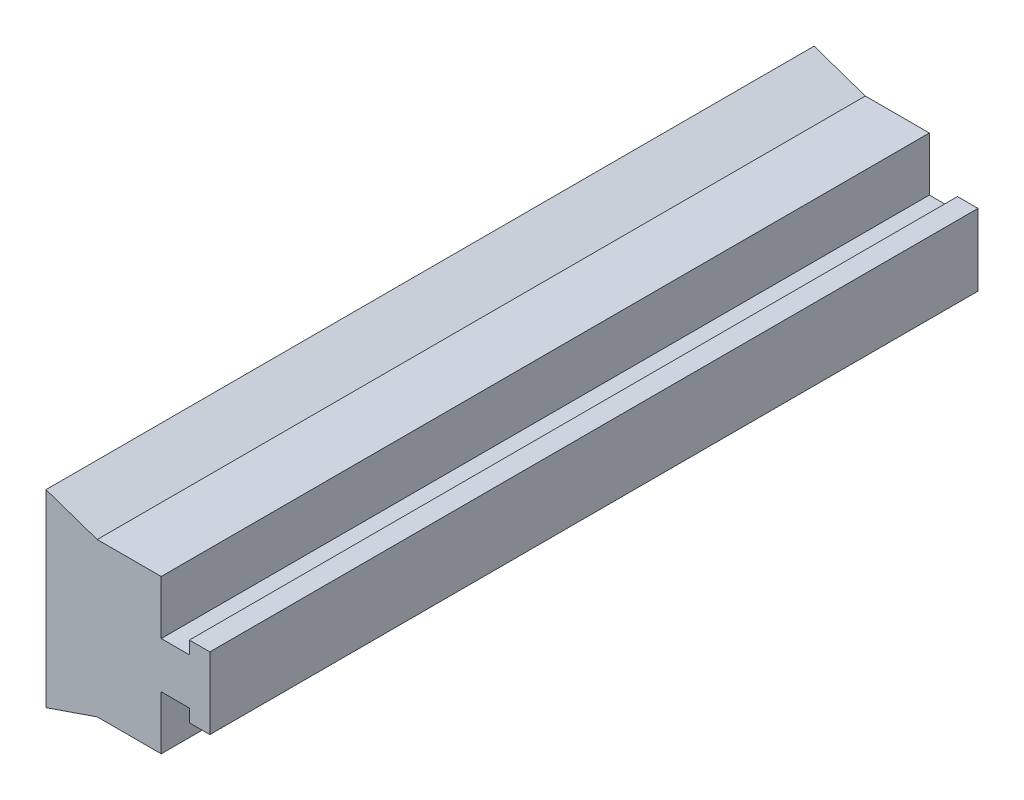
ISO-10303-21;
HEADER;
FILE_DESCRIPTION(('STEP AP214'),'2;1');
FILE_NAME('part.step','',(''),(''),'','','');
FILE_SCHEMA(('AUTOMOTIVE_DESIGN { 1 0 10303 214 1 1 1 1 }'));
ENDSEC;
DATA;
#1=APPLICATION_CONTEXT('core data for automotive mechanical design processes');
#2=APPLICATION_PROTOCOL_DEFINITION('international standard','automotive_design',2000,#1);
#3=PRODUCT_CONTEXT('',#1,'mechanical');
#4=PRODUCT('Part','Part','',(#3));
#5=PRODUCT_RELATED_PRODUCT_CATEGORY('part','',(#4));
#6=PRODUCT_DEFINITION_FORMATION('','',#4);
#7=PRODUCT_DEFINITION_CONTEXT('part definition',#1,'design');
#8=PRODUCT_DEFINITION('design','',#6,#7);
#9=PRODUCT_DEFINITION_SHAPE('','',#8);
#10=(LENGTH_UNIT() NAMED_UNIT(*) SI_UNIT(.MILLI.,.METRE.));
#11=(NAMED_UNIT(*) PLANE_ANGLE_UNIT() SI_UNIT($,.RADIAN.));
#12=(NAMED_UNIT(*) SI_UNIT($,.STERADIAN.) SOLID_ANGLE_UNIT());
#13=UNCERTAINTY_MEASURE_WITH_UNIT(LENGTH_MEASURE(1.E-05),#10,'distance_accuracy_value','');
#14=(GEOMETRIC_REPRESENTATION_CONTEXT(3) GLOBAL_UNCERTAINTY_ASSIGNED_CONTEXT((#13)) GLOBAL_UNIT_ASSIGNED_CONTEXT((#10,
#11,#12)) REPRESENTATION_CONTEXT('',''));
#15=CARTESIAN_POINT('',(0.,0.,0.));
#16=DIRECTION('',(0.,0.,1.));
#17=DIRECTION('',(1.,0.,0.));
#18=AXIS2_PLACEMENT_3D('',#15,#16,#17);
#19=CARTESIAN_POINT('',(-2.5,6.,30.));
#20=DIRECTION('',(-0.325079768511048,-0.945686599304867,0.));
#21=DIRECTION('',(0.945686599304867,-0.325079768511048,0.));
#22=AXIS2_PLACEMENT_3D('',#19,#20,#21);
#23=PLANE('',#22);
#24=DIRECTION('',(-0.945686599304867,0.325079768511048,0.));
#25=VECTOR('',#24,1.);
#26=CARTESIAN_POINT('',(-2.5,6.,-30.));
#27=LINE('',#26,#25);
#28=CARTESIAN_POINT('',(-2.5,6.,-30.));
#29=VERTEX_POINT('',#28);
#30=CARTESIAN_POINT('',(-6.5,7.375,-30.));
#31=VERTEX_POINT('',#30);
#32=EDGE_CURVE('E184',#29,#31,#27,.T.);
#33=ORIENTED_EDGE('',*,*,#32,.T.);
#34=DIRECTION('',(0.,0.,-1.));
#35=VECTOR('',#34,1.);
#36=CARTESIAN_POINT('',(-6.5,7.375,30.));
#37=LINE('',#36,#35);
#38=CARTESIAN_POINT('',(-6.5,7.375,30.));
#39=VERTEX_POINT('',#38);
#40=EDGE_CURVE('E11',#39,#31,#37,.T.);
#41=ORIENTED_EDGE('',*,*,#40,.F.);
#42=DIRECTION('',(-0.945686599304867,0.325079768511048,0.));
#43=VECTOR('',#42,1.);
#44=CARTESIAN_POINT('',(-2.5,6.,30.));
#45=LINE('',#44,#43);
#46=CARTESIAN_POINT('',(-2.5,6.,30.));
#47=VERTEX_POINT('',#46);
#48=EDGE_CURVE('E223',#47,#39,#45,.T.);
#49=ORIENTED_EDGE('',*,*,#48,.F.);
#50=DIRECTION('',(0.,0.,-1.));
#51=VECTOR('',#50,1.);
#52=CARTESIAN_POINT('',(-2.5,6.,30.));
#53=LINE('',#52,#51);
#54=EDGE_CURVE('E179',#47,#29,#53,.T.);
#55=ORIENTED_EDGE('',*,*,#54,.T.);
#56=EDGE_LOOP('',(#33,#41,#49,#55));
#57=FACE_BOUND('',#56,.T.);
#58=ADVANCED_FACE('F50',(#57),#23,.F.);
#59=CARTESIAN_POINT('',(-6.5,-7.375,30.));
#60=DIRECTION('',(1.,0.,0.));
#61=DIRECTION('',(0.,1.,0.));
#62=AXIS2_PLACEMENT_3D('',#59,#60,#61);
#63=PLANE('',#62);
#64=DIRECTION('',(0.,-1.,0.));
#65=VECTOR('',#64,1.);
#66=CARTESIAN_POINT('',(-6.5,-7.375,-30.));
#67=LINE('',#66,#65);
#68=CARTESIAN_POINT('',(-6.5,-7.375,-30.));
#69=VERTEX_POINT('',#68);
#70=EDGE_CURVE('E188',#31,#69,#67,.T.);
#71=ORIENTED_EDGE('',*,*,#70,.T.);
#72=DIRECTION('',(0.,0.,-1.));
#73=VECTOR('',#72,1.);
#74=CARTESIAN_POINT('',(-6.5,-7.375,30.));
#75=LINE('',#74,#73);
#76=CARTESIAN_POINT('',(-6.5,-7.375,30.));
#77=VERTEX_POINT('',#76);
#78=EDGE_CURVE('E57',#77,#69,#75,.T.);
#79=ORIENTED_EDGE('',*,*,#78,.F.);
#80=DIRECTION('',(0.,-1.,0.));
#81=VECTOR('',#80,1.);
#82=CARTESIAN_POINT('',(-6.5,-7.375,30.));
#83=LINE('',#82,#81);
#84=EDGE_CURVE('E124',#39,#77,#83,.T.);
#85=ORIENTED_EDGE('',*,*,#84,.F.);
#86=ORIENTED_EDGE('',*,*,#40,.T.);
#87=EDGE_LOOP('',(#71,#79,#85,#86));
#88=FACE_BOUND('',#87,.T.);
#89=ADVANCED_FACE('F334',(#88),#63,.F.);
#90=CARTESIAN_POINT('',(-2.5,-6.,30.));
#91=DIRECTION('',(-0.325079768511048,0.945686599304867,0.));
#92=DIRECTION('',(-0.945686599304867,-0.325079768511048,0.));
#93=AXIS2_PLACEMENT_3D('',#90,#91,#92);
#94=PLANE('',#93);
#95=DIRECTION('',(0.945686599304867,0.325079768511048,0.));
#96=VECTOR('',#95,1.);
#97=CARTESIAN_POINT('',(-2.5,-6.,-30.));
#98=LINE('',#97,#96);
#99=CARTESIAN_POINT('',(-2.5,-6.,-30.));
#100=VERTEX_POINT('',#99);
#101=EDGE_CURVE('E193',#69,#100,#98,.T.);
#102=ORIENTED_EDGE('',*,*,#101,.T.);
#103=DIRECTION('',(0.,0.,-1.));
#104=VECTOR('',#103,1.);
#105=CARTESIAN_POINT('',(-2.5,-6.,30.));
#106=LINE('',#105,#104);
#107=CARTESIAN_POINT('',(-2.5,-6.,30.));
#108=VERTEX_POINT('',#107);
#109=EDGE_CURVE('E257',#108,#100,#106,.T.);
#110=ORIENTED_EDGE('',*,*,#109,.F.);
#111=DIRECTION('',(0.945686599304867,0.325079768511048,0.));
#112=VECTOR('',#111,1.);
#113=CARTESIAN_POINT('',(-2.5,-6.,30.));
#114=LINE('',#113,#112);
#115=EDGE_CURVE('E269',#77,#108,#114,.T.);
#116=ORIENTED_EDGE('',*,*,#115,.F.);
#117=ORIENTED_EDGE('',*,*,#78,.T.);
#118=EDGE_LOOP('',(#102,#110,#116,#117));
#119=FACE_BOUND('',#118,.T.);
#120=ADVANCED_FACE('F268',(#119),#94,.F.);
#121=CARTESIAN_POINT('',(2.5,-6.,30.));
#122=DIRECTION('',(0.,1.,0.));
#123=DIRECTION('',(-1.,0.,0.));
#124=AXIS2_PLACEMENT_3D('',#121,#122,#123);
#125=PLANE('',#124);
#126=DIRECTION('',(1.,0.,0.));
#127=VECTOR('',#126,1.);
#128=CARTESIAN_POINT('',(2.5,-6.,-30.));
#129=LINE('',#128,#127);
#130=CARTESIAN_POINT('',(2.5,-6.,-30.));
#131=VERTEX_POINT('',#130);
#132=EDGE_CURVE('E192',#100,#131,#129,.T.);
#133=ORIENTED_EDGE('',*,*,#132,.T.);
#134=DIRECTION('',(0.,0.,-1.));
#135=VECTOR('',#134,1.);
#136=CARTESIAN_POINT('',(2.5,-6.,30.));
#137=LINE('',#136,#135);
#138=CARTESIAN_POINT('',(2.5,-6.,30.));
#139=VERTEX_POINT('',#138);
#140=EDGE_CURVE('E258',#139,#131,#137,.T.);
#141=ORIENTED_EDGE('',*,*,#140,.F.);
#142=DIRECTION('',(1.,0.,0.));
#143=VECTOR('',#142,1.);
#144=CARTESIAN_POINT('',(2.5,-6.,30.));
#145=LINE('',#144,#143);
#146=EDGE_CURVE('E287',#108,#139,#145,.T.);
#147=ORIENTED_EDGE('',*,*,#146,.F.);
#148=ORIENTED_EDGE('',*,*,#109,.T.);
#149=EDGE_LOOP('',(#133,#141,#147,#148));
#150=FACE_BOUND('',#149,.T.);
#151=ADVANCED_FACE('F276',(#150),#125,.F.);
#152=CARTESIAN_POINT('',(2.5,-6.,30.));
#153=DIRECTION('',(-1.,0.,0.));
#154=DIRECTION('',(0.,-1.,0.));
#155=AXIS2_PLACEMENT_3D('',#152,#153,#154);
#156=PLANE('',#155);
#157=DIRECTION('',(0.,1.,0.));
#158=VECTOR('',#157,1.);
#159=CARTESIAN_POINT('',(2.5,-6.,-30.));
#160=LINE('',#159,#158);
#161=CARTESIAN_POINT('',(2.5,-1.8,-30.));
#162=VERTEX_POINT('',#161);
#163=EDGE_CURVE('E197',#131,#162,#160,.T.);
#164=ORIENTED_EDGE('',*,*,#163,.T.);
#165=DIRECTION('',(0.,0.,-1.));
#166=VECTOR('',#165,1.);
#167=CARTESIAN_POINT('',(2.5,-1.8,30.));
#168=LINE('',#167,#166);
#169=CARTESIAN_POINT('',(2.5,-1.8,30.));
#170=VERTEX_POINT('',#169);
#171=EDGE_CURVE('E252',#170,#162,#168,.T.);
#172=ORIENTED_EDGE('',*,*,#171,.F.);
#173=DIRECTION('',(0.,1.,0.));
#174=VECTOR('',#173,1.);
#175=CARTESIAN_POINT('',(2.5,-6.,30.));
#176=LINE('',#175,#174);
#177=EDGE_CURVE('E281',#139,#170,#176,.T.);
#178=ORIENTED_EDGE('',*,*,#177,.F.);
#179=ORIENTED_EDGE('',*,*,#140,.T.);
#180=EDGE_LOOP('',(#164,#172,#178,#179));
#181=FACE_BOUND('',#180,.T.);
#182=ADVANCED_FACE('F283',(#181),#156,.F.);
#183=CARTESIAN_POINT('',(2.5,-1.8,30.));
#184=DIRECTION('',(0.,1.,0.));
#185=DIRECTION('',(-1.,0.,0.));
#186=AXIS2_PLACEMENT_3D('',#183,#184,#185);
#187=PLANE('',#186);
#188=DIRECTION('',(1.,0.,0.));
#189=VECTOR('',#188,1.);
#190=CARTESIAN_POINT('',(2.5,-1.8,-30.));
#191=LINE('',#190,#189);
#192=CARTESIAN_POINT('',(4.7,-1.8,-30.));
#193=VERTEX_POINT('',#192);
#194=EDGE_CURVE('E199',#162,#193,#191,.T.);
#195=ORIENTED_EDGE('',*,*,#194,.T.);
#196=DIRECTION('',(0.,0.,-1.));
#197=VECTOR('',#196,1.);
#198=CARTESIAN_POINT('',(4.7,-1.8,30.));
#199=LINE('',#198,#197);
#200=CARTESIAN_POINT('',(4.7,-1.8,30.));
#201=VERTEX_POINT('',#200);
#202=EDGE_CURVE('E246',#201,#193,#199,.T.);
#203=ORIENTED_EDGE('',*,*,#202,.F.);
#204=DIRECTION('',(1.,0.,0.));
#205=VECTOR('',#204,1.);
#206=CARTESIAN_POINT('',(2.5,-1.8,30.));
#207=LINE('',#206,#205);
#208=EDGE_CURVE('E286',#170,#201,#207,.T.);
#209=ORIENTED_EDGE('',*,*,#208,.F.);
#210=ORIENTED_EDGE('',*,*,#171,.T.);
#211=EDGE_LOOP('',(#195,#203,#209,#210));
#212=FACE_BOUND('',#211,.T.);
#213=ADVANCED_FACE('F347',(#212),#187,.F.);
#214=CARTESIAN_POINT('',(4.7,-1.8,30.));
#215=DIRECTION('',(1.,0.,0.));
#216=DIRECTION('',(0.,0.,-1.));
#217=AXIS2_PLACEMENT_3D('',#214,#215,#216);
#218=PLANE('',#217);
#219=DIRECTION('',(0.,-1.,0.));
#220=VECTOR('',#219,1.);
#221=CARTESIAN_POINT('',(4.7,-1.8,-30.));
#222=LINE('',#221,#220);
#223=CARTESIAN_POINT('',(4.7,-2.8,-30.));
#224=VERTEX_POINT('',#223);
#225=EDGE_CURVE('E201',#193,#224,#222,.T.);
#226=ORIENTED_EDGE('',*,*,#225,.T.);
#227=DIRECTION('',(0.,0.,-1.));
#228=VECTOR('',#227,1.);
#229=CARTESIAN_POINT('',(4.7,-2.8,30.));
#230=LINE('',#229,#228);
#231=CARTESIAN_POINT('',(4.7,-2.8,30.));
#232=VERTEX_POINT('',#231);
#233=EDGE_CURVE('E244',#232,#224,#230,.T.);
#234=ORIENTED_EDGE('',*,*,#233,.F.);
#235=DIRECTION('',(0.,-1.,0.));
#236=VECTOR('',#235,1.);
#237=CARTESIAN_POINT('',(4.7,-1.8,30.));
#238=LINE('',#237,#236);
#239=EDGE_CURVE('E291',#201,#232,#238,.T.);
#240=ORIENTED_EDGE('',*,*,#239,.F.);
#241=ORIENTED_EDGE('',*,*,#202,.T.);
#242=EDGE_LOOP('',(#226,#234,#240,#241));
#243=FACE_BOUND('',#242,.T.);
#244=ADVANCED_FACE('F349',(#243),#218,.F.);
#245=CARTESIAN_POINT('',(4.7,-2.8,30.));
#246=DIRECTION('',(0.,1.,0.));
#247=DIRECTION('',(0.,0.,1.));
#248=AXIS2_PLACEMENT_3D('',#245,#246,#247);
#249=PLANE('',#248);
#250=DIRECTION('',(1.,0.,0.));
#251=VECTOR('',#250,1.);
#252=CARTESIAN_POINT('',(4.7,-2.8,-30.));
#253=LINE('',#252,#251);
#254=CARTESIAN_POINT('',(6.3,-2.8,-30.));
#255=VERTEX_POINT('',#254);
#256=EDGE_CURVE('E206',#224,#255,#253,.T.);
#257=ORIENTED_EDGE('',*,*,#256,.T.);
#258=DIRECTION('',(0.,0.,-1.));
#259=VECTOR('',#258,1.);
#260=CARTESIAN_POINT('',(6.3,-2.8,30.));
#261=LINE('',#260,#259);
#262=CARTESIAN_POINT('',(6.3,-2.8,30.));
#263=VERTEX_POINT('',#262);
#264=EDGE_CURVE('E238',#263,#255,#261,.T.);
#265=ORIENTED_EDGE('',*,*,#264,.F.);
#266=DIRECTION('',(1.,0.,0.));
#267=VECTOR('',#266,1.);
#268=CARTESIAN_POINT('',(4.7,-2.8,30.));
#269=LINE('',#268,#267);
#270=EDGE_CURVE('E296',#232,#263,#269,.T.);
#271=ORIENTED_EDGE('',*,*,#270,.F.);
#272=ORIENTED_EDGE('',*,*,#233,.T.);
#273=EDGE_LOOP('',(#257,#265,#271,#272));
#274=FACE_BOUND('',#273,.T.);
#275=ADVANCED_FACE('F353',(#274),#249,.F.);
#276=CARTESIAN_POINT('',(6.3,2.8,30.));
#277=DIRECTION('',(-1.,0.,0.));
#278=DIRECTION('',(0.,0.,1.));
#279=AXIS2_PLACEMENT_3D('',#276,#277,#278);
#280=PLANE('',#279);
#281=DIRECTION('',(0.,1.,0.));
#282=VECTOR('',#281,1.);
#283=CARTESIAN_POINT('',(6.3,2.8,-30.));
#284=LINE('',#283,#282);
#285=CARTESIAN_POINT('',(6.3,2.8,-30.));
#286=VERTEX_POINT('',#285);
#287=EDGE_CURVE('E209',#255,#286,#284,.T.);
#288=ORIENTED_EDGE('',*,*,#287,.T.);
#289=DIRECTION('',(0.,0.,-1.));
#290=VECTOR('',#289,1.);
#291=CARTESIAN_POINT('',(6.3,2.8,30.));
#292=LINE('',#291,#290);
#293=CARTESIAN_POINT('',(6.3,2.8,30.));
#294=VERTEX_POINT('',#293);
#295=EDGE_CURVE('E237',#294,#286,#292,.T.);
#296=ORIENTED_EDGE('',*,*,#295,.F.);
#297=DIRECTION('',(0.,1.,0.));
#298=VECTOR('',#297,1.);
#299=CARTESIAN_POINT('',(6.3,-2.8,30.));
#300=LINE('',#299,#298);
#301=EDGE_CURVE('E301',#263,#294,#300,.T.);
#302=ORIENTED_EDGE('',*,*,#301,.F.);
#303=ORIENTED_EDGE('',*,*,#264,.T.);
#304=EDGE_LOOP('',(#288,#296,#302,#303));
#305=FACE_BOUND('',#304,.T.);
#306=ADVANCED_FACE('F360',(#305),#280,.F.);
#307=CARTESIAN_POINT('',(4.7,2.8,30.));
#308=DIRECTION('',(0.,-1.,0.));
#309=DIRECTION('',(0.,0.,-1.));
#310=AXIS2_PLACEMENT_3D('',#307,#308,#309);
#311=PLANE('',#310);
#312=DIRECTION('',(-1.,0.,0.));
#313=VECTOR('',#312,1.);
#314=CARTESIAN_POINT('',(4.7,2.8,-30.));
#315=LINE('',#314,#313);
#316=CARTESIAN_POINT('',(4.7,2.8,-30.));
#317=VERTEX_POINT('',#316);
#318=EDGE_CURVE('E213',#286,#317,#315,.T.);
#319=ORIENTED_EDGE('',*,*,#318,.T.);
#320=DIRECTION('',(0.,0.,-1.));
#321=VECTOR('',#320,1.);
#322=CARTESIAN_POINT('',(4.7,2.8,30.));
#323=LINE('',#322,#321);
#324=CARTESIAN_POINT('',(4.7,2.8,30.));
#325=VERTEX_POINT('',#324);
#326=EDGE_CURVE('E235',#325,#317,#323,.T.);
#327=ORIENTED_EDGE('',*,*,#326,.F.);
#328=DIRECTION('',(-1.,0.,0.));
#329=VECTOR('',#328,1.);
#330=CARTESIAN_POINT('',(4.7,2.8,30.));
#331=LINE('',#330,#329);
#332=EDGE_CURVE('E308',#294,#325,#331,.T.);
#333=ORIENTED_EDGE('',*,*,#332,.F.);
#334=ORIENTED_EDGE('',*,*,#295,.T.);
#335=EDGE_LOOP('',(#319,#327,#333,#334));
#336=FACE_BOUND('',#335,.T.);
#337=ADVANCED_FACE('F314',(#336),#311,.F.);
#338=CARTESIAN_POINT('',(4.7,1.8,30.));
#339=DIRECTION('',(1.,0.,0.));
#340=DIRECTION('',(0.,0.,-1.));
#341=AXIS2_PLACEMENT_3D('',#338,#339,#340);
#342=PLANE('',#341);
#343=DIRECTION('',(0.,-1.,0.));
#344=VECTOR('',#343,1.);
#345=CARTESIAN_POINT('',(4.7,1.8,-30.));
#346=LINE('',#345,#344);
#347=CARTESIAN_POINT('',(4.7,1.8,-30.));
#348=VERTEX_POINT('',#347);
#349=EDGE_CURVE('E216',#317,#348,#346,.T.);
#350=ORIENTED_EDGE('',*,*,#349,.T.);
#351=DIRECTION('',(0.,0.,-1.));
#352=VECTOR('',#351,1.);
#353=CARTESIAN_POINT('',(4.7,1.8,30.));
#354=LINE('',#353,#352);
#355=CARTESIAN_POINT('',(4.7,1.8,30.));
#356=VERTEX_POINT('',#355);
#357=EDGE_CURVE('E173',#356,#348,#354,.T.);
#358=ORIENTED_EDGE('',*,*,#357,.F.);
#359=DIRECTION('',(0.,-1.,0.));
#360=VECTOR('',#359,1.);
#361=CARTESIAN_POINT('',(4.7,1.8,30.));
#362=LINE('',#361,#360);
#363=EDGE_CURVE('E165',#325,#356,#362,.T.);
#364=ORIENTED_EDGE('',*,*,#363,.F.);
#365=ORIENTED_EDGE('',*,*,#326,.T.);
#366=EDGE_LOOP('',(#350,#358,#364,#365));
#367=FACE_BOUND('',#366,.T.);
#368=ADVANCED_FACE('F318',(#367),#342,.F.);
#369=CARTESIAN_POINT('',(2.5,1.8,30.));
#370=DIRECTION('',(0.,-1.,0.));
#371=DIRECTION('',(0.,0.,-1.));
#372=AXIS2_PLACEMENT_3D('',#369,#370,#371);
#373=PLANE('',#372);
#374=DIRECTION('',(-1.,0.,0.));
#375=VECTOR('',#374,1.);
#376=CARTESIAN_POINT('',(2.5,1.8,-30.));
#377=LINE('',#376,#375);
#378=CARTESIAN_POINT('',(2.5,1.8,-30.));
#379=VERTEX_POINT('',#378);
#380=EDGE_CURVE('E172',#348,#379,#377,.T.);
#381=ORIENTED_EDGE('',*,*,#380,.T.);
#382=DIRECTION('',(0.,0.,-1.));
#383=VECTOR('',#382,1.);
#384=CARTESIAN_POINT('',(2.5,1.8,30.));
#385=LINE('',#384,#383);
#386=CARTESIAN_POINT('',(2.5,1.8,30.));
#387=VERTEX_POINT('',#386);
#388=EDGE_CURVE('E169',#387,#379,#385,.T.);
#389=ORIENTED_EDGE('',*,*,#388,.F.);
#390=DIRECTION('',(-1.,0.,0.));
#391=VECTOR('',#390,1.);
#392=CARTESIAN_POINT('',(2.5,1.8,30.));
#393=LINE('',#392,#391);
#394=EDGE_CURVE('E156',#356,#387,#393,.T.);
#395=ORIENTED_EDGE('',*,*,#394,.F.);
#396=ORIENTED_EDGE('',*,*,#357,.T.);
#397=EDGE_LOOP('',(#381,#389,#395,#396));
#398=FACE_BOUND('',#397,.T.);
#399=ADVANCED_FACE('F166',(#398),#373,.F.);
#400=CARTESIAN_POINT('',(2.5,6.,30.));
#401=DIRECTION('',(-1.,0.,0.));
#402=DIRECTION('',(0.,0.,1.));
#403=AXIS2_PLACEMENT_3D('',#400,#401,#402);
#404=PLANE('',#403);
#405=DIRECTION('',(0.,1.,0.));
#406=VECTOR('',#405,1.);
#407=CARTESIAN_POINT('',(2.5,6.,-30.));
#408=LINE('',#407,#406);
#409=CARTESIAN_POINT('',(2.5,6.,-30.));
#410=VERTEX_POINT('',#409);
#411=EDGE_CURVE('E112',#379,#410,#408,.T.);
#412=ORIENTED_EDGE('',*,*,#411,.T.);
#413=DIRECTION('',(0.,0.,-1.));
#414=VECTOR('',#413,1.);
#415=CARTESIAN_POINT('',(2.5,6.,30.));
#416=LINE('',#415,#414);
#417=CARTESIAN_POINT('',(2.5,6.,30.));
#418=VERTEX_POINT('',#417);
#419=EDGE_CURVE('E174',#418,#410,#416,.T.);
#420=ORIENTED_EDGE('',*,*,#419,.F.);
#421=DIRECTION('',(0.,1.,0.));
#422=VECTOR('',#421,1.);
#423=CARTESIAN_POINT('',(2.5,6.,30.));
#424=LINE('',#423,#422);
#425=EDGE_CURVE('E159',#387,#418,#424,.T.);
#426=ORIENTED_EDGE('',*,*,#425,.F.);
#427=ORIENTED_EDGE('',*,*,#388,.T.);
#428=EDGE_LOOP('',(#412,#420,#426,#427));
#429=FACE_BOUND('',#428,.T.);
#430=ADVANCED_FACE('F178',(#429),#404,.F.);
#431=CARTESIAN_POINT('',(2.5,6.,30.));
#432=DIRECTION('',(0.,-1.,0.));
#433=DIRECTION('',(1.,0.,0.));
#434=AXIS2_PLACEMENT_3D('',#431,#432,#433);
#435=PLANE('',#434);
#436=DIRECTION('',(-1.,0.,0.));
#437=VECTOR('',#436,1.);
#438=CARTESIAN_POINT('',(2.5,6.,-30.));
#439=LINE('',#438,#437);
#440=EDGE_CURVE('E120',#410,#29,#439,.T.);
#441=ORIENTED_EDGE('',*,*,#440,.T.);
#442=ORIENTED_EDGE('',*,*,#54,.F.);
#443=DIRECTION('',(-1.,0.,0.));
#444=VECTOR('',#443,1.);
#445=CARTESIAN_POINT('',(2.5,6.,30.));
#446=LINE('',#445,#444);
#447=EDGE_CURVE('E64',#418,#47,#446,.T.);
#448=ORIENTED_EDGE('',*,*,#447,.F.);
#449=ORIENTED_EDGE('',*,*,#419,.T.);
#450=EDGE_LOOP('',(#441,#442,#448,#449));
#451=FACE_BOUND('',#450,.T.);
#452=ADVANCED_FACE('F325',(#451),#435,.F.);
#453=CARTESIAN_POINT('',(0.,0.,30.));
#454=DIRECTION('',(0.,0.,-1.));
#455=DIRECTION('',(-1.,0.,0.));
#456=AXIS2_PLACEMENT_3D('',#453,#454,#455);
#457=PLANE('',#456);
#458=ORIENTED_EDGE('',*,*,#48,.T.);
#459=ORIENTED_EDGE('',*,*,#84,.T.);
#460=ORIENTED_EDGE('',*,*,#115,.T.);
#461=ORIENTED_EDGE('',*,*,#146,.T.);
#462=ORIENTED_EDGE('',*,*,#177,.T.);
#463=ORIENTED_EDGE('',*,*,#208,.T.);
#464=ORIENTED_EDGE('',*,*,#239,.T.);
#465=ORIENTED_EDGE('',*,*,#270,.T.);
#466=ORIENTED_EDGE('',*,*,#301,.T.);
#467=ORIENTED_EDGE('',*,*,#332,.T.);
#468=ORIENTED_EDGE('',*,*,#363,.T.);
#469=ORIENTED_EDGE('',*,*,#394,.T.);
#470=ORIENTED_EDGE('',*,*,#425,.T.);
#471=ORIENTED_EDGE('',*,*,#447,.T.);
#472=EDGE_LOOP('',(#458,#459,#460,#461,#462,#463,#464,#465,#466,#467,#468,#469,#470,#471));
#473=FACE_BOUND('',#472,.T.);
#474=ADVANCED_FACE('F158',(#473),#457,.F.);
#475=CARTESIAN_POINT('',(0.,0.,-30.));
#476=DIRECTION('',(0.,0.,-1.));
#477=DIRECTION('',(-1.,0.,0.));
#478=AXIS2_PLACEMENT_3D('',#475,#476,#477);
#479=PLANE('',#478);
#480=ORIENTED_EDGE('',*,*,#32,.F.);
#481=ORIENTED_EDGE('',*,*,#440,.F.);
#482=ORIENTED_EDGE('',*,*,#411,.F.);
#483=ORIENTED_EDGE('',*,*,#380,.F.);
#484=ORIENTED_EDGE('',*,*,#349,.F.);
#485=ORIENTED_EDGE('',*,*,#318,.F.);
#486=ORIENTED_EDGE('',*,*,#287,.F.);
#487=ORIENTED_EDGE('',*,*,#256,.F.);
#488=ORIENTED_EDGE('',*,*,#225,.F.);
#489=ORIENTED_EDGE('',*,*,#194,.F.);
#490=ORIENTED_EDGE('',*,*,#163,.F.);
#491=ORIENTED_EDGE('',*,*,#132,.F.);
#492=ORIENTED_EDGE('',*,*,#101,.F.);
#493=ORIENTED_EDGE('',*,*,#70,.F.);
#494=EDGE_LOOP('',(#480,#481,#482,#483,#484,#485,#486,#487,#488,#489,#490,#491,#492,#493));
#495=FACE_BOUND('',#494,.T.);
#496=ADVANCED_FACE('F273',(#495),#479,.T.);
#497=CLOSED_SHELL('',(#58,#89,#120,#151,#182,#213,#244,#275,#306,#337,#368,#399,#430,#452,#474,#496));
#498=MANIFOLD_SOLID_BREP('B2',#497);
#499=ADVANCED_BREP_SHAPE_REPRESENTATION('',(#18,#498),#14);
#500=SHAPE_DEFINITION_REPRESENTATION(#9,#499);
ENDSEC;
END-ISO-10303-21;
